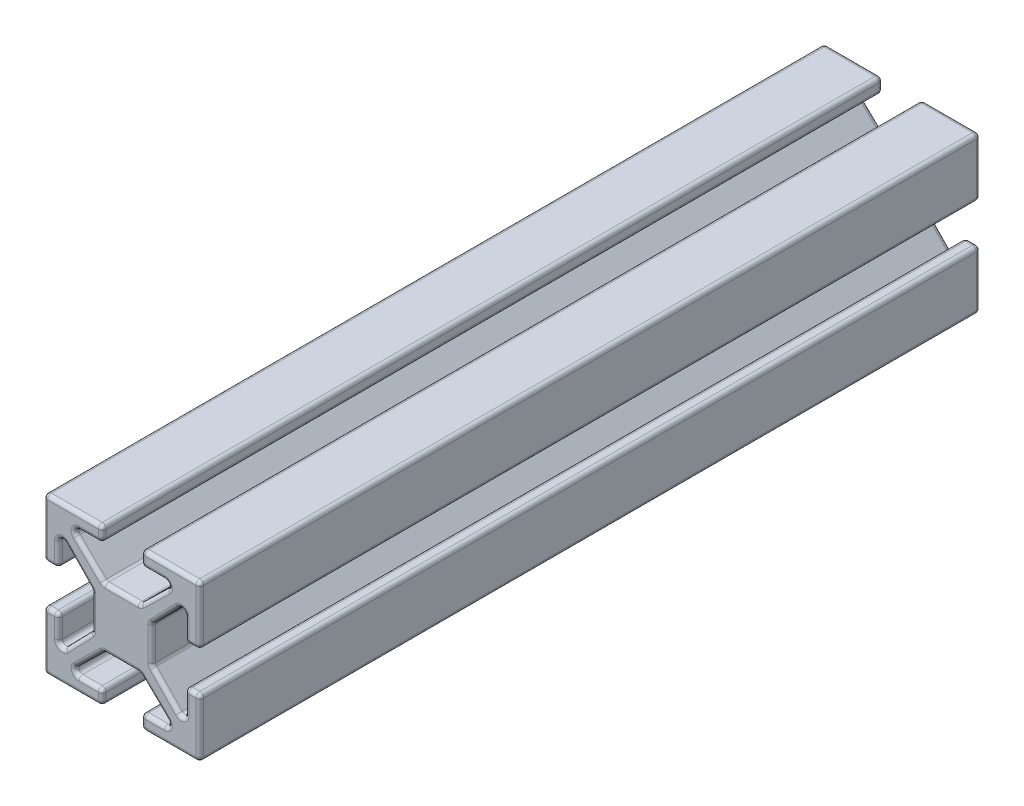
from build123d import *

# Parameters (mm, degrees)
BOSS_EXTRUDE1_DEPTH = 200
FILLET3_R           = 1


with BuildPart() as part:
    # Sketch1 → Boss-Extrude1 (new body)
    with BuildSketch(Plane.XY):
        Polygon((-5, 16.212568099), (-5, 20), (-20, 20), (-20, 5), (-16.212568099, 5), (-16.212568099, 13.432263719), (-7.689389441, 4.631155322), (-7.689389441, 0), (-7.689389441, -4.631155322), (-16.212568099, -13.432263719), (-16.212568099, -5), (-20, -5), (-20, -20), (-5, -20), (-5, -16.212568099), (-13.432263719, -16.212568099), (-4.631155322, -7.689389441), (0, -7.689389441), (4.631155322, -7.689389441), (13.432263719, -16.212568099), (5, -16.212568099), (5, -20), (20, -20), (20, -5), (16.212568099, -5), (16.212568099, -13.432263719), (7.689389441, -4.631155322), (7.689389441, 0), (7.689389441, 4.631155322), (16.212568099, 13.432263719), (16.212568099, 5), (20, 5), (20, 20), (5, 20), (5, 16.212568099), (13.432263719, 16.212568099), (4.631155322, 7.689389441), (0, 7.689389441), (-4.631155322, 7.689389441), (-13.432263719, 16.212568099), align=None)
    extrude(amount=BOSS_EXTRUDE1_DEPTH)

    # Fillet3
    fillet3_edges = [part.edges().sort_by_distance(p)[0] for p in [
        (5, 18.10628405, 200),
        (9.216131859, 16.212568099, 200),
        (9.03170952, 11.95097877, 200),
        (0, -7.689389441, 200),
        (0, 7.689389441, 200),
        (-9.03170952, 11.95097877, 200),
        (-9.216131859, 16.212568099, 200),
        (-5, 18.10628405, 200),
        (-12.5, 20, 200),
        (-20, 12.5, 200),
        (-18.10628405, 5, 200),
        (-16.212568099, 9.216131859, 200),
        (-11.95097877, 9.03170952, 200),
        (-7.689389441, 0, 200),
        (-11.95097877, -9.03170952, 200),
        (-16.212568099, -9.216131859, 200),
        (9.031709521, -11.95097877, 200),
        (-18.10628405, -5, 200),
        (-20, -12.5, 200),
        (-12.5, -20, 200),
        (-5, -18.10628405, 200),
        (-9.216131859, -16.212568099, 200),
        (9.216131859, -16.212568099, 200),
        (5, -18.10628405, 200),
        (12.5, -20, 200),
        (-9.216131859, -16.212568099, 0),
        (-5, -18.10628405, 0),
        (-12.5, -20, 0),
        (-20, -12.5, 0),
        (20, -12.5, 200),
        (-18.10628405, -5, 0),
        (-16.212568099, -9.216131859, 0),
        (-11.95097877, -9.03170952, 0),
        (-7.689389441, 0, 0),
        (-11.95097877, 9.03170952, 0),
        (-16.212568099, 9.216131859, 0),
        (-18.10628405, 5, 0),
        (-20, 12.5, 0),
        (-12.5, 20, 0),
        (-5, 18.10628405, 0),
        (18.10628405, -5, 200),
        (-9.216131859, 16.212568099, 0),
        (-9.03170952, 11.95097877, 0),
        (0, 7.689389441, 0),
        (9.03170952, 11.95097877, 0),
        (9.216131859, 16.212568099, 0),
        (5, 18.10628405, 0),
        (12.5, 20, 0),
        (20, 12.5, 0),
        (18.10628405, 5, 0),
        (16.212568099, -9.216131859, 200),
        (16.212568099, 9.216131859, 0),
        (11.95097877, 9.03170952, 0),
        (7.689389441, 0, 0),
        (11.95097877, -9.03170952, 0),
        (16.212568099, -9.216131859, 0),
        (18.10628405, -5, 0),
        (20, -12.5, 0),
        (12.5, -20, 0),
        (5, -18.10628405, 0),
        (-9.03170952, -11.95097877, 200),
        (9.216131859, -16.212568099, 0),
        (11.95097877, -9.03170952, 200),
        (9.031709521, -11.95097877, 0),
        (0, -7.689389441, 0),
        (-9.03170952, -11.95097877, 0),
        (7.689389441, 0, 200),
        (-13.432263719, -16.212568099, 100),
        (-5, -16.212568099, 100),
        (-5, -20, 100),
        (-20, -20, 100),
        (-20, -5, 100),
        (11.95097877, 9.03170952, 200),
        (-16.212568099, -5, 100),
        (-16.212568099, -13.432263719, 100),
        (-7.689389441, -4.631155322, 100),
        (-7.689389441, 4.631155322, 100),
        (-16.212568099, 13.432263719, 100),
        (-16.212568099, 5, 100),
        (-20, 5, 100),
        (-20, 20, 100),
        (-5, 20, 100),
        (-5, 16.212568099, 100),
        (-13.432263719, 16.212568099, 100),
        (-4.631155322, 7.689389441, 100),
        (4.631155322, 7.689389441, 100),
        (13.432263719, 16.212568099, 100),
        (5, 16.212568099, 100),
        (5, 20, 100),
        (20, 20, 100),
        (20, 5, 100),
        (16.212568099, 5, 100),
        (16.212568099, 13.432263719, 100),
        (7.689389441, 4.631155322, 100),
        (7.689389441, -4.631155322, 100),
        (16.212568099, -13.432263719, 100),
        (16.212568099, -5, 100),
        (20, -5, 100),
        (20, -20, 100),
        (5, -20, 100),
        (5, -16.212568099, 100),
        (13.432263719, -16.212568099, 100),
        (4.631155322, -7.689389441, 100),
        (-4.631155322, -7.689389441, 100),
        (16.212568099, 9.216131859, 200),
        (18.10628405, 5, 200),
        (20, 12.5, 200),
        (12.5, 20, 200),
    ]]
    fillet(fillet3_edges, radius=FILLET3_R)


solid = part.part
